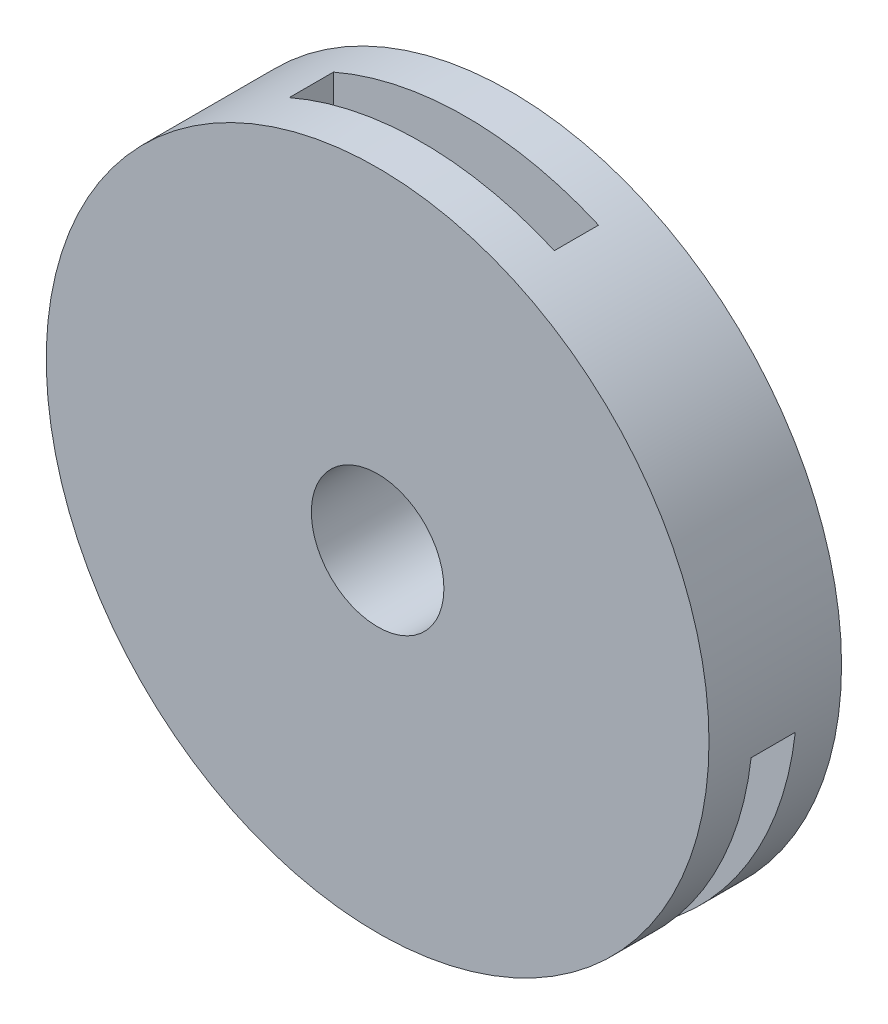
ISO-10303-21;
HEADER;
FILE_DESCRIPTION(('STEP AP214'),'2;1');
FILE_NAME('part.step','',(''),(''),'','','');
FILE_SCHEMA(('AUTOMOTIVE_DESIGN { 1 0 10303 214 1 1 1 1 }'));
ENDSEC;
DATA;
#1=APPLICATION_CONTEXT('core data for automotive mechanical design processes');
#2=APPLICATION_PROTOCOL_DEFINITION('international standard','automotive_design',2000,#1);
#3=PRODUCT_CONTEXT('',#1,'mechanical');
#4=PRODUCT('Part','Part','',(#3));
#5=PRODUCT_RELATED_PRODUCT_CATEGORY('part','',(#4));
#6=PRODUCT_DEFINITION_FORMATION('','',#4);
#7=PRODUCT_DEFINITION_CONTEXT('part definition',#1,'design');
#8=PRODUCT_DEFINITION('design','',#6,#7);
#9=PRODUCT_DEFINITION_SHAPE('','',#8);
#10=(LENGTH_UNIT() NAMED_UNIT(*) SI_UNIT(.MILLI.,.METRE.));
#11=(NAMED_UNIT(*) PLANE_ANGLE_UNIT() SI_UNIT($,.RADIAN.));
#12=(NAMED_UNIT(*) SI_UNIT($,.STERADIAN.) SOLID_ANGLE_UNIT());
#13=UNCERTAINTY_MEASURE_WITH_UNIT(LENGTH_MEASURE(1.E-05),#10,'distance_accuracy_value','');
#14=(GEOMETRIC_REPRESENTATION_CONTEXT(3) GLOBAL_UNCERTAINTY_ASSIGNED_CONTEXT((#13)) GLOBAL_UNIT_ASSIGNED_CONTEXT((#10,
#11,#12)) REPRESENTATION_CONTEXT('',''));
#15=CARTESIAN_POINT('',(0.,0.,0.));
#16=DIRECTION('',(0.,0.,1.));
#17=DIRECTION('',(1.,0.,0.));
#18=AXIS2_PLACEMENT_3D('',#15,#16,#17);
#19=CARTESIAN_POINT('',(0.,0.,30.));
#20=DIRECTION('',(0.,0.,-1.));
#21=DIRECTION('',(-1.,0.,0.));
#22=AXIS2_PLACEMENT_3D('',#19,#20,#21);
#23=CYLINDRICAL_SURFACE('',#22,75.);
#24=CARTESIAN_POINT('',(0.,0.,10.));
#25=DIRECTION('',(0.,0.,1.));
#26=DIRECTION('',(1.,0.,0.));
#27=AXIS2_PLACEMENT_3D('',#24,#25,#26);
#28=CIRCLE('',#27,75.);
#29=CARTESIAN_POINT('',(-44.529404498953,-60.3500798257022,10.));
#30=VERTEX_POINT('',#29);
#31=CARTESIAN_POINT('',(-74.5294044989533,-8.38855559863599,10.));
#32=VERTEX_POINT('',#31);
#33=EDGE_CURVE('E161',#30,#32,#28,.F.);
#34=ORIENTED_EDGE('',*,*,#33,.T.);
#35=DIRECTION('',(0.,0.,-1.));
#36=VECTOR('',#35,1.);
#37=CARTESIAN_POINT('',(-74.5294044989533,-8.38855559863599,30.));
#38=LINE('',#37,#36);
#39=CARTESIAN_POINT('',(-74.5294044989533,-8.38855559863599,20.));
#40=VERTEX_POINT('',#39);
#41=EDGE_CURVE('E183',#32,#40,#38,.F.);
#42=ORIENTED_EDGE('',*,*,#41,.T.);
#43=CARTESIAN_POINT('',(0.,0.,20.));
#44=DIRECTION('',(0.,0.,-1.));
#45=DIRECTION('',(0.,1.,0.));
#46=AXIS2_PLACEMENT_3D('',#43,#44,#45);
#47=CIRCLE('',#46,75.);
#48=CARTESIAN_POINT('',(-44.529404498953,-60.3500798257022,20.));
#49=VERTEX_POINT('',#48);
#50=EDGE_CURVE('E125',#40,#49,#47,.F.);
#51=ORIENTED_EDGE('',*,*,#50,.T.);
#52=DIRECTION('',(0.,0.,-1.));
#53=VECTOR('',#52,1.);
#54=CARTESIAN_POINT('',(-44.529404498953,-60.3500798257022,30.));
#55=LINE('',#54,#53);
#56=EDGE_CURVE('E158',#49,#30,#55,.T.);
#57=ORIENTED_EDGE('',*,*,#56,.T.);
#58=EDGE_LOOP('',(#34,#42,#51,#57));
#59=FACE_BOUND('',#58,.T.);
#60=CARTESIAN_POINT('',(0.,0.,0.));
#61=DIRECTION('',(0.,0.,1.));
#62=DIRECTION('',(1.,0.,0.));
#63=AXIS2_PLACEMENT_3D('',#60,#61,#62);
#64=CIRCLE('',#63,75.);
#65=CARTESIAN_POINT('',(75.,0.,0.));
#66=VERTEX_POINT('',#65);
#67=EDGE_CURVE('E34',#66,#66,#64,.T.);
#68=ORIENTED_EDGE('',*,*,#67,.T.);
#69=EDGE_LOOP('',(#68));
#70=FACE_BOUND('',#69,.T.);
#71=CARTESIAN_POINT('',(0.,0.,30.));
#72=DIRECTION('',(0.,0.,1.));
#73=DIRECTION('',(1.,0.,0.));
#74=AXIS2_PLACEMENT_3D('',#71,#72,#73);
#75=CIRCLE('',#74,75.);
#76=CARTESIAN_POINT('',(75.,0.,30.));
#77=VERTEX_POINT('',#76);
#78=EDGE_CURVE('E11',#77,#77,#75,.T.);
#79=ORIENTED_EDGE('',*,*,#78,.F.);
#80=EDGE_LOOP('',(#79));
#81=FACE_BOUND('',#80,.T.);
#82=CARTESIAN_POINT('',(0.,0.,10.));
#83=DIRECTION('',(0.,0.,1.));
#84=DIRECTION('',(1.,0.,0.));
#85=AXIS2_PLACEMENT_3D('',#82,#83,#84);
#86=CIRCLE('',#85,75.);
#87=CARTESIAN_POINT('',(-30.,68.7386354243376,10.));
#88=VERTEX_POINT('',#87);
#89=CARTESIAN_POINT('',(30.,68.7386354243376,10.));
#90=VERTEX_POINT('',#89);
#91=EDGE_CURVE('E192',#88,#90,#86,.F.);
#92=ORIENTED_EDGE('',*,*,#91,.T.);
#93=DIRECTION('',(0.,0.,-1.));
#94=VECTOR('',#93,1.);
#95=CARTESIAN_POINT('',(30.,68.7386354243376,30.));
#96=LINE('',#95,#94);
#97=CARTESIAN_POINT('',(30.,68.7386354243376,20.));
#98=VERTEX_POINT('',#97);
#99=EDGE_CURVE('E215',#90,#98,#96,.F.);
#100=ORIENTED_EDGE('',*,*,#99,.T.);
#101=CARTESIAN_POINT('',(0.,0.,20.));
#102=DIRECTION('',(0.,0.,-1.));
#103=DIRECTION('',(-1.,0.,0.));
#104=AXIS2_PLACEMENT_3D('',#101,#102,#103);
#105=CIRCLE('',#104,75.);
#106=CARTESIAN_POINT('',(-30.,68.7386354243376,20.));
#107=VERTEX_POINT('',#106);
#108=EDGE_CURVE('E186',#98,#107,#105,.F.);
#109=ORIENTED_EDGE('',*,*,#108,.T.);
#110=DIRECTION('',(0.,0.,-1.));
#111=VECTOR('',#110,1.);
#112=CARTESIAN_POINT('',(-30.,68.7386354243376,30.));
#113=LINE('',#112,#111);
#114=EDGE_CURVE('E189',#107,#88,#113,.T.);
#115=ORIENTED_EDGE('',*,*,#114,.T.);
#116=EDGE_LOOP('',(#92,#100,#109,#115));
#117=FACE_BOUND('',#116,.T.);
#118=CARTESIAN_POINT('',(0.,0.,10.));
#119=DIRECTION('',(0.,0.,1.));
#120=DIRECTION('',(1.,0.,0.));
#121=AXIS2_PLACEMENT_3D('',#118,#119,#120);
#122=CIRCLE('',#121,75.);
#123=CARTESIAN_POINT('',(74.5294044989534,-8.38855559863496,10.));
#124=VERTEX_POINT('',#123);
#125=CARTESIAN_POINT('',(44.5294044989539,-60.3500798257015,10.));
#126=VERTEX_POINT('',#125);
#127=EDGE_CURVE('E130',#124,#126,#122,.F.);
#128=ORIENTED_EDGE('',*,*,#127,.T.);
#129=DIRECTION('',(0.,0.,-1.));
#130=VECTOR('',#129,1.);
#131=CARTESIAN_POINT('',(44.5294044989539,-60.3500798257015,30.));
#132=LINE('',#131,#130);
#133=CARTESIAN_POINT('',(44.5294044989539,-60.3500798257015,20.));
#134=VERTEX_POINT('',#133);
#135=EDGE_CURVE('E117',#126,#134,#132,.F.);
#136=ORIENTED_EDGE('',*,*,#135,.T.);
#137=CARTESIAN_POINT('',(0.,0.,20.));
#138=DIRECTION('',(0.,0.,-1.));
#139=DIRECTION('',(0.,1.,0.));
#140=AXIS2_PLACEMENT_3D('',#137,#138,#139);
#141=CIRCLE('',#140,75.);
#142=CARTESIAN_POINT('',(74.5294044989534,-8.38855559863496,20.));
#143=VERTEX_POINT('',#142);
#144=EDGE_CURVE('E142',#134,#143,#141,.F.);
#145=ORIENTED_EDGE('',*,*,#144,.T.);
#146=DIRECTION('',(0.,0.,-1.));
#147=VECTOR('',#146,1.);
#148=CARTESIAN_POINT('',(74.5294044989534,-8.38855559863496,30.));
#149=LINE('',#148,#147);
#150=EDGE_CURVE('E138',#143,#124,#149,.T.);
#151=ORIENTED_EDGE('',*,*,#150,.T.);
#152=EDGE_LOOP('',(#128,#136,#145,#151));
#153=FACE_BOUND('',#152,.T.);
#154=ADVANCED_FACE('F31',(#59,#70,#81,#117,#153),#23,.T.);
#155=CARTESIAN_POINT('',(0.,0.,30.));
#156=DIRECTION('',(0.,0.,1.));
#157=DIRECTION('',(1.,0.,0.));
#158=AXIS2_PLACEMENT_3D('',#155,#156,#157);
#159=PLANE('',#158);
#160=CARTESIAN_POINT('',(0.,0.,30.));
#161=DIRECTION('',(0.,0.,1.));
#162=DIRECTION('',(1.,0.,0.));
#163=AXIS2_PLACEMENT_3D('',#160,#161,#162);
#164=CIRCLE('',#163,15.);
#165=CARTESIAN_POINT('',(15.,0.,30.));
#166=VERTEX_POINT('',#165);
#167=EDGE_CURVE('E409',#166,#166,#164,.T.);
#168=ORIENTED_EDGE('',*,*,#167,.F.);
#169=EDGE_LOOP('',(#168));
#170=FACE_BOUND('',#169,.T.);
#171=ORIENTED_EDGE('',*,*,#78,.T.);
#172=EDGE_LOOP('',(#171));
#173=FACE_BOUND('',#172,.T.);
#174=ADVANCED_FACE('F226',(#170,#173),#159,.T.);
#175=CARTESIAN_POINT('',(0.,0.,0.));
#176=DIRECTION('',(0.,0.,1.));
#177=DIRECTION('',(1.,0.,0.));
#178=AXIS2_PLACEMENT_3D('',#175,#176,#177);
#179=PLANE('',#178);
#180=CARTESIAN_POINT('',(0.,0.,0.));
#181=DIRECTION('',(0.,0.,1.));
#182=DIRECTION('',(1.,0.,0.));
#183=AXIS2_PLACEMENT_3D('',#180,#181,#182);
#184=CIRCLE('',#183,15.);
#185=CARTESIAN_POINT('',(15.,0.,0.));
#186=VERTEX_POINT('',#185);
#187=EDGE_CURVE('E406',#186,#186,#184,.T.);
#188=ORIENTED_EDGE('',*,*,#187,.T.);
#189=EDGE_LOOP('',(#188));
#190=FACE_BOUND('',#189,.T.);
#191=ORIENTED_EDGE('',*,*,#67,.F.);
#192=EDGE_LOOP('',(#191));
#193=FACE_BOUND('',#192,.T.);
#194=ADVANCED_FACE('F223',(#190,#193),#179,.F.);
#195=CARTESIAN_POINT('',(0.,75.001,10.));
#196=DIRECTION('',(0.,0.,1.));
#197=DIRECTION('',(1.,0.,0.));
#198=AXIS2_PLACEMENT_3D('',#195,#196,#197);
#199=PLANE('',#198);
#200=DIRECTION('',(0.,-1.,0.));
#201=VECTOR('',#200,1.);
#202=CARTESIAN_POINT('',(-30.,75.001,10.));
#203=LINE('',#202,#201);
#204=CARTESIAN_POINT('',(-30.,40.,10.));
#205=VERTEX_POINT('',#204);
#206=EDGE_CURVE('E213',#88,#205,#203,.T.);
#207=ORIENTED_EDGE('',*,*,#206,.T.);
#208=DIRECTION('',(-1.,0.,0.));
#209=VECTOR('',#208,1.);
#210=CARTESIAN_POINT('',(0.,40.,10.));
#211=LINE('',#210,#209);
#212=CARTESIAN_POINT('',(30.,40.,10.));
#213=VERTEX_POINT('',#212);
#214=EDGE_CURVE('E195',#213,#205,#211,.T.);
#215=ORIENTED_EDGE('',*,*,#214,.F.);
#216=DIRECTION('',(0.,-1.,0.));
#217=VECTOR('',#216,1.);
#218=CARTESIAN_POINT('',(30.,75.001,10.));
#219=LINE('',#218,#217);
#220=EDGE_CURVE('E207',#90,#213,#219,.T.);
#221=ORIENTED_EDGE('',*,*,#220,.F.);
#222=ORIENTED_EDGE('',*,*,#91,.F.);
#223=EDGE_LOOP('',(#207,#215,#221,#222));
#224=FACE_BOUND('',#223,.T.);
#225=ADVANCED_FACE('F225',(#224),#199,.T.);
#226=CARTESIAN_POINT('',(-30.,75.001,10.));
#227=DIRECTION('',(1.,0.,0.));
#228=DIRECTION('',(0.,0.,-1.));
#229=AXIS2_PLACEMENT_3D('',#226,#227,#228);
#230=PLANE('',#229);
#231=DIRECTION('',(0.,-1.,0.));
#232=VECTOR('',#231,1.);
#233=CARTESIAN_POINT('',(-30.,75.001,20.));
#234=LINE('',#233,#232);
#235=CARTESIAN_POINT('',(-30.,40.,20.));
#236=VERTEX_POINT('',#235);
#237=EDGE_CURVE('E211',#107,#236,#234,.T.);
#238=ORIENTED_EDGE('',*,*,#237,.T.);
#239=DIRECTION('',(0.,0.,1.));
#240=VECTOR('',#239,1.);
#241=CARTESIAN_POINT('',(-30.,40.,10.));
#242=LINE('',#241,#240);
#243=EDGE_CURVE('E198',#205,#236,#242,.T.);
#244=ORIENTED_EDGE('',*,*,#243,.F.);
#245=ORIENTED_EDGE('',*,*,#206,.F.);
#246=ORIENTED_EDGE('',*,*,#114,.F.);
#247=EDGE_LOOP('',(#238,#244,#245,#246));
#248=FACE_BOUND('',#247,.T.);
#249=ADVANCED_FACE('F232',(#248),#230,.T.);
#250=CARTESIAN_POINT('',(-30.,75.001,20.));
#251=DIRECTION('',(0.,0.,-1.));
#252=DIRECTION('',(-1.,0.,0.));
#253=AXIS2_PLACEMENT_3D('',#250,#251,#252);
#254=PLANE('',#253);
#255=DIRECTION('',(0.,-1.,0.));
#256=VECTOR('',#255,1.);
#257=CARTESIAN_POINT('',(30.,75.001,20.));
#258=LINE('',#257,#256);
#259=CARTESIAN_POINT('',(30.,40.,20.));
#260=VERTEX_POINT('',#259);
#261=EDGE_CURVE('E209',#98,#260,#258,.T.);
#262=ORIENTED_EDGE('',*,*,#261,.T.);
#263=DIRECTION('',(1.,0.,0.));
#264=VECTOR('',#263,1.);
#265=CARTESIAN_POINT('',(-30.,40.,20.));
#266=LINE('',#265,#264);
#267=EDGE_CURVE('E201',#236,#260,#266,.T.);
#268=ORIENTED_EDGE('',*,*,#267,.F.);
#269=ORIENTED_EDGE('',*,*,#237,.F.);
#270=ORIENTED_EDGE('',*,*,#108,.F.);
#271=EDGE_LOOP('',(#262,#268,#269,#270));
#272=FACE_BOUND('',#271,.T.);
#273=ADVANCED_FACE('F276',(#272),#254,.T.);
#274=CARTESIAN_POINT('',(30.,75.001,20.));
#275=DIRECTION('',(-1.,0.,0.));
#276=DIRECTION('',(0.,0.,1.));
#277=AXIS2_PLACEMENT_3D('',#274,#275,#276);
#278=PLANE('',#277);
#279=ORIENTED_EDGE('',*,*,#220,.T.);
#280=DIRECTION('',(0.,0.,-1.));
#281=VECTOR('',#280,1.);
#282=CARTESIAN_POINT('',(30.,40.,20.));
#283=LINE('',#282,#281);
#284=EDGE_CURVE('E204',#260,#213,#283,.T.);
#285=ORIENTED_EDGE('',*,*,#284,.F.);
#286=ORIENTED_EDGE('',*,*,#261,.F.);
#287=ORIENTED_EDGE('',*,*,#99,.F.);
#288=EDGE_LOOP('',(#279,#285,#286,#287));
#289=FACE_BOUND('',#288,.T.);
#290=ADVANCED_FACE('F272',(#289),#278,.T.);
#291=CARTESIAN_POINT('',(-30.,40.,10.));
#292=DIRECTION('',(0.,1.,0.));
#293=DIRECTION('',(0.,0.,1.));
#294=AXIS2_PLACEMENT_3D('',#291,#292,#293);
#295=PLANE('',#294);
#296=ORIENTED_EDGE('',*,*,#214,.T.);
#297=ORIENTED_EDGE('',*,*,#243,.T.);
#298=ORIENTED_EDGE('',*,*,#267,.T.);
#299=ORIENTED_EDGE('',*,*,#284,.T.);
#300=EDGE_LOOP('',(#296,#297,#298,#299));
#301=FACE_BOUND('',#300,.T.);
#302=ADVANCED_FACE('F269',(#301),#295,.T.);
#303=CARTESIAN_POINT('',(-88.7271356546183,-51.2266356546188,10.));
#304=DIRECTION('',(0.,0.,1.));
#305=DIRECTION('',(1.,0.,0.));
#306=AXIS2_PLACEMENT_3D('',#303,#304,#305);
#307=PLANE('',#306);
#308=DIRECTION('',(0.866025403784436,0.500000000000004,0.));
#309=VECTOR('',#308,1.);
#310=CARTESIAN_POINT('',(-73.7271356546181,-77.2073977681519,10.));
#311=LINE('',#310,#309);
#312=CARTESIAN_POINT('',(-19.6410161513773,-45.9807621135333,10.));
#313=VERTEX_POINT('',#312);
#314=EDGE_CURVE('E181',#30,#313,#311,.T.);
#315=ORIENTED_EDGE('',*,*,#314,.T.);
#316=DIRECTION('',(0.500000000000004,-0.866025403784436,0.));
#317=VECTOR('',#316,1.);
#318=CARTESIAN_POINT('',(-34.6410161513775,-20.0000000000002,10.));
#319=LINE('',#318,#317);
#320=CARTESIAN_POINT('',(-49.6410161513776,5.98076211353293,10.));
#321=VERTEX_POINT('',#320);
#322=EDGE_CURVE('E164',#321,#313,#319,.T.);
#323=ORIENTED_EDGE('',*,*,#322,.F.);
#324=DIRECTION('',(0.866025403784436,0.500000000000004,0.));
#325=VECTOR('',#324,1.);
#326=CARTESIAN_POINT('',(-103.727135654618,-25.2458735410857,10.));
#327=LINE('',#326,#325);
#328=EDGE_CURVE('E176',#32,#321,#327,.T.);
#329=ORIENTED_EDGE('',*,*,#328,.F.);
#330=ORIENTED_EDGE('',*,*,#33,.F.);
#331=EDGE_LOOP('',(#315,#323,#329,#330));
#332=FACE_BOUND('',#331,.T.);
#333=ADVANCED_FACE('F245',(#332),#307,.T.);
#334=CARTESIAN_POINT('',(-73.7271356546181,-77.2073977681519,10.));
#335=DIRECTION('',(-0.500000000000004,0.866025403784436,0.));
#336=DIRECTION('',(-0.866025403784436,-0.500000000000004,0.));
#337=AXIS2_PLACEMENT_3D('',#334,#335,#336);
#338=PLANE('',#337);
#339=DIRECTION('',(0.866025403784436,0.500000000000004,0.));
#340=VECTOR('',#339,1.);
#341=CARTESIAN_POINT('',(-73.7271356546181,-77.2073977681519,20.));
#342=LINE('',#341,#340);
#343=CARTESIAN_POINT('',(-19.6410161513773,-45.9807621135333,20.));
#344=VERTEX_POINT('',#343);
#345=EDGE_CURVE('E179',#49,#344,#342,.T.);
#346=ORIENTED_EDGE('',*,*,#345,.T.);
#347=DIRECTION('',(0.,0.,1.));
#348=VECTOR('',#347,1.);
#349=CARTESIAN_POINT('',(-19.6410161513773,-45.9807621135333,10.));
#350=LINE('',#349,#348);
#351=EDGE_CURVE('E167',#313,#344,#350,.T.);
#352=ORIENTED_EDGE('',*,*,#351,.F.);
#353=ORIENTED_EDGE('',*,*,#314,.F.);
#354=ORIENTED_EDGE('',*,*,#56,.F.);
#355=EDGE_LOOP('',(#346,#352,#353,#354));
#356=FACE_BOUND('',#355,.T.);
#357=ADVANCED_FACE('F249',(#356),#338,.T.);
#358=CARTESIAN_POINT('',(-73.7271356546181,-77.2073977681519,20.));
#359=DIRECTION('',(0.,0.,-1.));
#360=DIRECTION('',(0.,1.,0.));
#361=AXIS2_PLACEMENT_3D('',#358,#359,#360);
#362=PLANE('',#361);
#363=DIRECTION('',(0.866025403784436,0.500000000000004,0.));
#364=VECTOR('',#363,1.);
#365=CARTESIAN_POINT('',(-103.727135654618,-25.2458735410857,20.));
#366=LINE('',#365,#364);
#367=CARTESIAN_POINT('',(-49.6410161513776,5.98076211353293,20.));
#368=VERTEX_POINT('',#367);
#369=EDGE_CURVE('E53',#40,#368,#366,.T.);
#370=ORIENTED_EDGE('',*,*,#369,.T.);
#371=DIRECTION('',(-0.500000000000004,0.866025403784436,0.));
#372=VECTOR('',#371,1.);
#373=CARTESIAN_POINT('',(-19.6410161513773,-45.9807621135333,20.));
#374=LINE('',#373,#372);
#375=EDGE_CURVE('E170',#344,#368,#374,.T.);
#376=ORIENTED_EDGE('',*,*,#375,.F.);
#377=ORIENTED_EDGE('',*,*,#345,.F.);
#378=ORIENTED_EDGE('',*,*,#50,.F.);
#379=EDGE_LOOP('',(#370,#376,#377,#378));
#380=FACE_BOUND('',#379,.T.);
#381=ADVANCED_FACE('F255',(#380),#362,.T.);
#382=CARTESIAN_POINT('',(-103.727135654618,-25.2458735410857,20.));
#383=DIRECTION('',(0.500000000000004,-0.866025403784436,0.));
#384=DIRECTION('',(0.866025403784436,0.500000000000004,0.));
#385=AXIS2_PLACEMENT_3D('',#382,#383,#384);
#386=PLANE('',#385);
#387=ORIENTED_EDGE('',*,*,#328,.T.);
#388=DIRECTION('',(0.,0.,-1.));
#389=VECTOR('',#388,1.);
#390=CARTESIAN_POINT('',(-49.6410161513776,5.98076211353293,20.));
#391=LINE('',#390,#389);
#392=EDGE_CURVE('E173',#368,#321,#391,.T.);
#393=ORIENTED_EDGE('',*,*,#392,.F.);
#394=ORIENTED_EDGE('',*,*,#369,.F.);
#395=ORIENTED_EDGE('',*,*,#41,.F.);
#396=EDGE_LOOP('',(#387,#393,#394,#395));
#397=FACE_BOUND('',#396,.T.);
#398=ADVANCED_FACE('F257',(#397),#386,.T.);
#399=CARTESIAN_POINT('',(-19.6410161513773,-45.9807621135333,10.));
#400=DIRECTION('',(-0.866025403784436,-0.500000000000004,0.));
#401=DIRECTION('',(0.,0.,1.));
#402=AXIS2_PLACEMENT_3D('',#399,#400,#401);
#403=PLANE('',#402);
#404=ORIENTED_EDGE('',*,*,#322,.T.);
#405=ORIENTED_EDGE('',*,*,#351,.T.);
#406=ORIENTED_EDGE('',*,*,#375,.T.);
#407=ORIENTED_EDGE('',*,*,#392,.T.);
#408=EDGE_LOOP('',(#404,#405,#406,#407));
#409=FACE_BOUND('',#408,.T.);
#410=ADVANCED_FACE('F253',(#409),#403,.T.);
#411=CARTESIAN_POINT('',(88.7271356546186,-51.2266356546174,10.));
#412=DIRECTION('',(0.,0.,1.));
#413=DIRECTION('',(1.,0.,0.));
#414=AXIS2_PLACEMENT_3D('',#411,#412,#413);
#415=PLANE('',#414);
#416=DIRECTION('',(-0.866025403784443,0.499999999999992,0.));
#417=VECTOR('',#416,1.);
#418=CARTESIAN_POINT('',(103.727135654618,-25.2458735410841,10.));
#419=LINE('',#418,#417);
#420=CARTESIAN_POINT('',(49.6410161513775,5.98076211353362,10.));
#421=VERTEX_POINT('',#420);
#422=EDGE_CURVE('E126',#124,#421,#419,.T.);
#423=ORIENTED_EDGE('',*,*,#422,.T.);
#424=DIRECTION('',(0.499999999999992,0.866025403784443,0.));
#425=VECTOR('',#424,1.);
#426=CARTESIAN_POINT('',(34.6410161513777,-19.9999999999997,10.));
#427=LINE('',#426,#425);
#428=CARTESIAN_POINT('',(19.641016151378,-45.980762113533,10.));
#429=VERTEX_POINT('',#428);
#430=EDGE_CURVE('E133',#429,#421,#427,.T.);
#431=ORIENTED_EDGE('',*,*,#430,.F.);
#432=DIRECTION('',(-0.866025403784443,0.499999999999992,0.));
#433=VECTOR('',#432,1.);
#434=CARTESIAN_POINT('',(73.7271356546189,-77.2073977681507,10.));
#435=LINE('',#434,#433);
#436=EDGE_CURVE('E120',#126,#429,#435,.T.);
#437=ORIENTED_EDGE('',*,*,#436,.F.);
#438=ORIENTED_EDGE('',*,*,#127,.F.);
#439=EDGE_LOOP('',(#423,#431,#437,#438));
#440=FACE_BOUND('',#439,.T.);
#441=ADVANCED_FACE('F129',(#440),#415,.T.);
#442=CARTESIAN_POINT('',(103.727135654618,-25.2458735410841,10.));
#443=DIRECTION('',(-0.499999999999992,-0.866025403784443,0.));
#444=DIRECTION('',(0.866025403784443,-0.499999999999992,0.));
#445=AXIS2_PLACEMENT_3D('',#442,#443,#444);
#446=PLANE('',#445);
#447=DIRECTION('',(-0.866025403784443,0.499999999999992,0.));
#448=VECTOR('',#447,1.);
#449=CARTESIAN_POINT('',(103.727135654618,-25.2458735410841,20.));
#450=LINE('',#449,#448);
#451=CARTESIAN_POINT('',(49.6410161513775,5.98076211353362,20.));
#452=VERTEX_POINT('',#451);
#453=EDGE_CURVE('E153',#143,#452,#450,.T.);
#454=ORIENTED_EDGE('',*,*,#453,.T.);
#455=DIRECTION('',(0.,0.,1.));
#456=VECTOR('',#455,1.);
#457=CARTESIAN_POINT('',(49.6410161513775,5.98076211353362,10.));
#458=LINE('',#457,#456);
#459=EDGE_CURVE('E140',#421,#452,#458,.T.);
#460=ORIENTED_EDGE('',*,*,#459,.F.);
#461=ORIENTED_EDGE('',*,*,#422,.F.);
#462=ORIENTED_EDGE('',*,*,#150,.F.);
#463=EDGE_LOOP('',(#454,#460,#461,#462));
#464=FACE_BOUND('',#463,.T.);
#465=ADVANCED_FACE('F342',(#464),#446,.T.);
#466=CARTESIAN_POINT('',(103.727135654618,-25.2458735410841,20.));
#467=DIRECTION('',(0.,0.,-1.));
#468=DIRECTION('',(0.,1.,0.));
#469=AXIS2_PLACEMENT_3D('',#466,#467,#468);
#470=PLANE('',#469);
#471=DIRECTION('',(-0.866025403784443,0.499999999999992,0.));
#472=VECTOR('',#471,1.);
#473=CARTESIAN_POINT('',(73.7271356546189,-77.2073977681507,20.));
#474=LINE('',#473,#472);
#475=CARTESIAN_POINT('',(19.641016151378,-45.980762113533,20.));
#476=VERTEX_POINT('',#475);
#477=EDGE_CURVE('E45',#134,#476,#474,.T.);
#478=ORIENTED_EDGE('',*,*,#477,.T.);
#479=DIRECTION('',(-0.499999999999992,-0.866025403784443,0.));
#480=VECTOR('',#479,1.);
#481=CARTESIAN_POINT('',(49.6410161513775,5.98076211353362,20.));
#482=LINE('',#481,#480);
#483=EDGE_CURVE('E148',#452,#476,#482,.T.);
#484=ORIENTED_EDGE('',*,*,#483,.F.);
#485=ORIENTED_EDGE('',*,*,#453,.F.);
#486=ORIENTED_EDGE('',*,*,#144,.F.);
#487=EDGE_LOOP('',(#478,#484,#485,#486));
#488=FACE_BOUND('',#487,.T.);
#489=ADVANCED_FACE('F351',(#488),#470,.T.);
#490=CARTESIAN_POINT('',(73.7271356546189,-77.2073977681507,20.));
#491=DIRECTION('',(0.499999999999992,0.866025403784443,0.));
#492=DIRECTION('',(-0.866025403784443,0.499999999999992,0.));
#493=AXIS2_PLACEMENT_3D('',#490,#491,#492);
#494=PLANE('',#493);
#495=ORIENTED_EDGE('',*,*,#436,.T.);
#496=DIRECTION('',(0.,0.,-1.));
#497=VECTOR('',#496,1.);
#498=CARTESIAN_POINT('',(19.641016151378,-45.980762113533,20.));
#499=LINE('',#498,#497);
#500=EDGE_CURVE('E135',#476,#429,#499,.T.);
#501=ORIENTED_EDGE('',*,*,#500,.F.);
#502=ORIENTED_EDGE('',*,*,#477,.F.);
#503=ORIENTED_EDGE('',*,*,#135,.F.);
#504=EDGE_LOOP('',(#495,#501,#502,#503));
#505=FACE_BOUND('',#504,.T.);
#506=ADVANCED_FACE('F119',(#505),#494,.T.);
#507=CARTESIAN_POINT('',(49.6410161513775,5.98076211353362,10.));
#508=DIRECTION('',(0.866025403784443,-0.499999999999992,0.));
#509=DIRECTION('',(0.,0.,1.));
#510=AXIS2_PLACEMENT_3D('',#507,#508,#509);
#511=PLANE('',#510);
#512=ORIENTED_EDGE('',*,*,#430,.T.);
#513=ORIENTED_EDGE('',*,*,#459,.T.);
#514=ORIENTED_EDGE('',*,*,#483,.T.);
#515=ORIENTED_EDGE('',*,*,#500,.T.);
#516=EDGE_LOOP('',(#512,#513,#514,#515));
#517=FACE_BOUND('',#516,.T.);
#518=ADVANCED_FACE('F370',(#517),#511,.T.);
#519=CARTESIAN_POINT('',(0.,0.,0.));
#520=DIRECTION('',(0.,0.,1.));
#521=DIRECTION('',(1.,0.,0.));
#522=AXIS2_PLACEMENT_3D('',#519,#520,#521);
#523=CYLINDRICAL_SURFACE('',#522,15.);
#524=ORIENTED_EDGE('',*,*,#187,.F.);
#525=EDGE_LOOP('',(#524));
#526=FACE_BOUND('',#525,.T.);
#527=ORIENTED_EDGE('',*,*,#167,.T.);
#528=EDGE_LOOP('',(#527));
#529=FACE_BOUND('',#528,.T.);
#530=ADVANCED_FACE('F379',(#526,#529),#523,.F.);
#531=CLOSED_SHELL('',(#154,#174,#194,#225,#249,#273,#290,#302,#333,#357,#381,#398,#410,#441,
#465,#489,#506,#518,#530));
#532=MANIFOLD_SOLID_BREP('B2',#531);
#533=ADVANCED_BREP_SHAPE_REPRESENTATION('',(#18,#532),#14);
#534=SHAPE_DEFINITION_REPRESENTATION(#9,#533);
ENDSEC;
END-ISO-10303-21;
